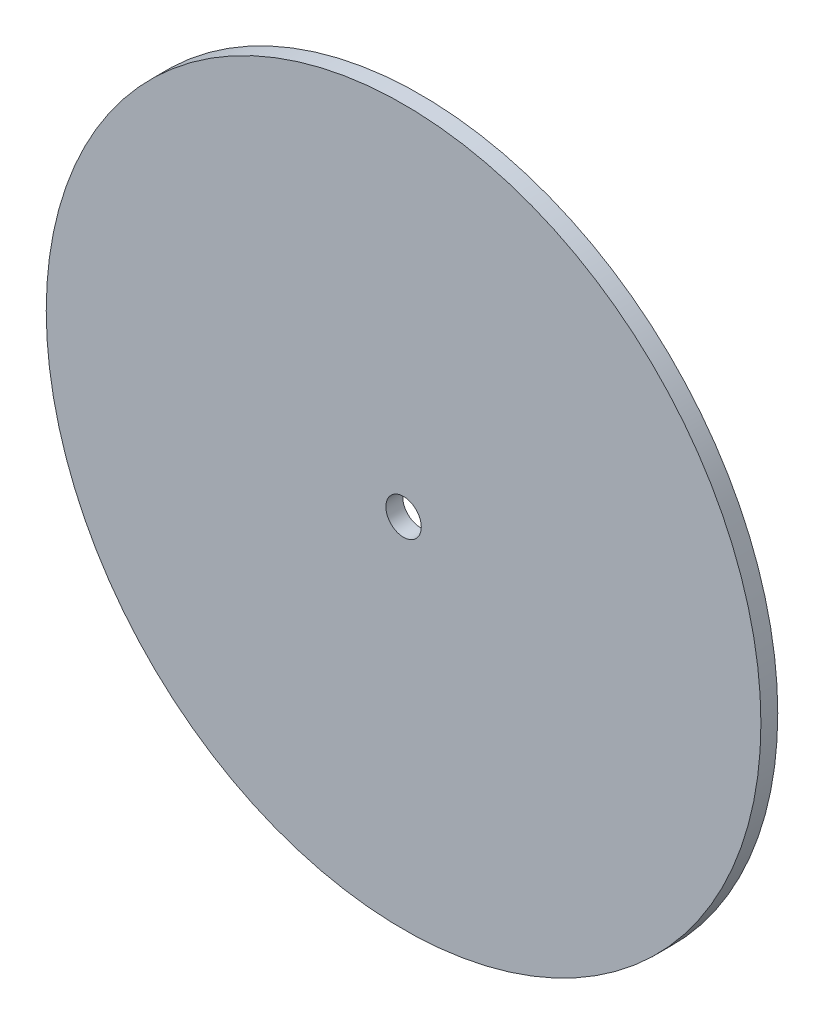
ISO-10303-21;
HEADER;
FILE_DESCRIPTION(('STEP AP214'),'2;1');
FILE_NAME('part.step','',(''),(''),'','','');
FILE_SCHEMA(('AUTOMOTIVE_DESIGN { 1 0 10303 214 1 1 1 1 }'));
ENDSEC;
DATA;
#1=APPLICATION_CONTEXT('core data for automotive mechanical design processes');
#2=APPLICATION_PROTOCOL_DEFINITION('international standard','automotive_design',2000,#1);
#3=PRODUCT_CONTEXT('',#1,'mechanical');
#4=PRODUCT('Part','Part','',(#3));
#5=PRODUCT_RELATED_PRODUCT_CATEGORY('part','',(#4));
#6=PRODUCT_DEFINITION_FORMATION('','',#4);
#7=PRODUCT_DEFINITION_CONTEXT('part definition',#1,'design');
#8=PRODUCT_DEFINITION('design','',#6,#7);
#9=PRODUCT_DEFINITION_SHAPE('','',#8);
#10=(LENGTH_UNIT() NAMED_UNIT(*) SI_UNIT(.MILLI.,.METRE.));
#11=(NAMED_UNIT(*) PLANE_ANGLE_UNIT() SI_UNIT($,.RADIAN.));
#12=(NAMED_UNIT(*) SI_UNIT($,.STERADIAN.) SOLID_ANGLE_UNIT());
#13=UNCERTAINTY_MEASURE_WITH_UNIT(LENGTH_MEASURE(1.E-05),#10,'distance_accuracy_value','');
#14=(GEOMETRIC_REPRESENTATION_CONTEXT(3) GLOBAL_UNCERTAINTY_ASSIGNED_CONTEXT((#13)) GLOBAL_UNIT_ASSIGNED_CONTEXT((#10,
#11,#12)) REPRESENTATION_CONTEXT('',''));
#15=CARTESIAN_POINT('',(0.,0.,0.));
#16=DIRECTION('',(0.,0.,1.));
#17=DIRECTION('',(1.,0.,0.));
#18=AXIS2_PLACEMENT_3D('',#15,#16,#17);
#19=CARTESIAN_POINT('',(0.,0.,5.));
#20=DIRECTION('',(0.,0.,-1.));
#21=DIRECTION('',(-1.,0.,0.));
#22=AXIS2_PLACEMENT_3D('',#19,#20,#21);
#23=CYLINDRICAL_SURFACE('',#22,106.);
#24=CARTESIAN_POINT('',(0.,0.,5.));
#25=DIRECTION('',(0.,0.,1.));
#26=DIRECTION('',(1.,0.,0.));
#27=AXIS2_PLACEMENT_3D('',#24,#25,#26);
#28=CIRCLE('',#27,106.);
#29=CARTESIAN_POINT('',(-106.,0.,5.));
#30=VERTEX_POINT('',#29);
#31=EDGE_CURVE('E12',#30,#30,#28,.T.);
#32=CARTESIAN_POINT('',(0.,0.,0.));
#33=DIRECTION('',(0.,0.,1.));
#34=DIRECTION('',(1.,0.,0.));
#35=AXIS2_PLACEMENT_3D('',#32,#33,#34);
#36=CIRCLE('',#35,106.);
#37=CARTESIAN_POINT('',(-106.,0.,0.));
#38=VERTEX_POINT('',#37);
#39=EDGE_CURVE('E52',#38,#38,#36,.T.);
#40=CARTESIAN_POINT('',(-106.,0.,5.));
#41=CARTESIAN_POINT('',(-106.,0.,4.94791666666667));
#42=CARTESIAN_POINT('',(-106.,0.,4.89583333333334));
#43=CARTESIAN_POINT('',(-106.,0.,4.79166666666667));
#44=CARTESIAN_POINT('',(-106.,0.,4.73958333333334));
#45=CARTESIAN_POINT('',(-106.,0.,4.63541666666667));
#46=CARTESIAN_POINT('',(-106.,0.,4.58333333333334));
#47=CARTESIAN_POINT('',(-106.,0.,4.47916666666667));
#48=CARTESIAN_POINT('',(-106.,0.,4.42708333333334));
#49=CARTESIAN_POINT('',(-106.,0.,4.32291666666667));
#50=CARTESIAN_POINT('',(-106.,0.,4.27083333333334));
#51=CARTESIAN_POINT('',(-106.,0.,4.16666666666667));
#52=CARTESIAN_POINT('',(-106.,0.,4.11458333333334));
#53=CARTESIAN_POINT('',(-106.,0.,4.01041666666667));
#54=CARTESIAN_POINT('',(-106.,0.,3.95833333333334));
#55=CARTESIAN_POINT('',(-106.,0.,3.85416666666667));
#56=CARTESIAN_POINT('',(-106.,0.,3.80208333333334));
#57=CARTESIAN_POINT('',(-106.,0.,3.69791666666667));
#58=CARTESIAN_POINT('',(-106.,0.,3.64583333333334));
#59=CARTESIAN_POINT('',(-106.,0.,3.54166666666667));
#60=CARTESIAN_POINT('',(-106.,0.,3.48958333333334));
#61=CARTESIAN_POINT('',(-106.,0.,3.38541666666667));
#62=CARTESIAN_POINT('',(-106.,0.,3.33333333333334));
#63=CARTESIAN_POINT('',(-106.,0.,3.22916666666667));
#64=CARTESIAN_POINT('',(-106.,0.,3.17708333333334));
#65=CARTESIAN_POINT('',(-106.,0.,3.07291666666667));
#66=CARTESIAN_POINT('',(-106.,0.,3.02083333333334));
#67=CARTESIAN_POINT('',(-106.,0.,2.91666666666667));
#68=CARTESIAN_POINT('',(-106.,0.,2.86458333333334));
#69=CARTESIAN_POINT('',(-106.,0.,2.76041666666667));
#70=CARTESIAN_POINT('',(-106.,0.,2.70833333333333));
#71=CARTESIAN_POINT('',(-106.,0.,2.60416666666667));
#72=CARTESIAN_POINT('',(-106.,0.,2.55208333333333));
#73=CARTESIAN_POINT('',(-106.,0.,2.44791666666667));
#74=CARTESIAN_POINT('',(-106.,0.,2.39583333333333));
#75=CARTESIAN_POINT('',(-106.,0.,2.29166666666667));
#76=CARTESIAN_POINT('',(-106.,0.,2.23958333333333));
#77=CARTESIAN_POINT('',(-106.,0.,2.13541666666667));
#78=CARTESIAN_POINT('',(-106.,0.,2.08333333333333));
#79=CARTESIAN_POINT('',(-106.,0.,1.97916666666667));
#80=CARTESIAN_POINT('',(-106.,0.,1.92708333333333));
#81=CARTESIAN_POINT('',(-106.,0.,1.82291666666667));
#82=CARTESIAN_POINT('',(-106.,0.,1.77083333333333));
#83=CARTESIAN_POINT('',(-106.,0.,1.66666666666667));
#84=CARTESIAN_POINT('',(-106.,0.,1.61458333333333));
#85=CARTESIAN_POINT('',(-106.,0.,1.51041666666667));
#86=CARTESIAN_POINT('',(-106.,0.,1.45833333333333));
#87=CARTESIAN_POINT('',(-106.,0.,1.35416666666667));
#88=CARTESIAN_POINT('',(-106.,0.,1.30208333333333));
#89=CARTESIAN_POINT('',(-106.,0.,1.19791666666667));
#90=CARTESIAN_POINT('',(-106.,0.,1.14583333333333));
#91=CARTESIAN_POINT('',(-106.,0.,1.04166666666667));
#92=CARTESIAN_POINT('',(-106.,0.,0.989583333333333));
#93=CARTESIAN_POINT('',(-106.,0.,0.885416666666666));
#94=CARTESIAN_POINT('',(-106.,0.,0.833333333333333));
#95=CARTESIAN_POINT('',(-106.,0.,0.729166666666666));
#96=CARTESIAN_POINT('',(-106.,0.,0.677083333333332));
#97=CARTESIAN_POINT('',(-106.,0.,0.572916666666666));
#98=CARTESIAN_POINT('',(-106.,0.,0.520833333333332));
#99=CARTESIAN_POINT('',(-106.,0.,0.416666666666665));
#100=CARTESIAN_POINT('',(-106.,0.,0.364583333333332));
#101=CARTESIAN_POINT('',(-106.,0.,0.260416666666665));
#102=CARTESIAN_POINT('',(-106.,0.,0.208333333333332));
#103=CARTESIAN_POINT('',(-106.,0.,0.104166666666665));
#104=CARTESIAN_POINT('',(-106.,0.,0.0520833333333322));
#105=CARTESIAN_POINT('',(-106.,0.,0.));
#106=B_SPLINE_CURVE_WITH_KNOTS('',3,(#40,#41,#42,#43,#44,#45,#46,#47,#48,#49,#50,#51,#52,#53,
#54,#55,#56,#57,#58,#59,#60,#61,#62,#63,#64,#65,#66,#67,#68,#69,#70,#71,#72,#73,#74,#75,#76,#77,
#78,#79,#80,#81,#82,#83,#84,#85,#86,#87,#88,#89,#90,#91,#92,#93,#94,#95,#96,#97,#98,#99,#100,
#101,#102,#103,#104,#105),.UNSPECIFIED.,.F.,.F.,(4,2,2,2,2,2,2,2,2,2,2,2,2,2,2,2,2,2,2,2,2,2,2,
2,2,2,2,2,2,2,2,2,4),(0.,0.156249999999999,0.312499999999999,0.46875,0.625,0.781250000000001,
0.9375,1.09375,1.25,1.40625,1.5625,1.71875,1.875,2.03125,2.1875,2.34375,2.5,2.65625,2.8125,
2.96875,3.125,3.28125,3.4375,3.59375,3.75,3.90625,4.0625,4.21875,4.375,4.53125000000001,
4.68750000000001,4.84375000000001,5.),.UNSPECIFIED.);
#107=EDGE_CURVE('BSEAM49',#30,#38,#106,.T.);
#108=ORIENTED_EDGE('',*,*,#31,.F.);
#109=ORIENTED_EDGE('',*,*,#39,.T.);
#110=ORIENTED_EDGE('',*,*,#107,.T.);
#111=ORIENTED_EDGE('',*,*,#107,.F.);
#112=EDGE_LOOP('',(#108,#110,#109,#111));
#113=FACE_BOUND('',#112,.T.);
#114=ADVANCED_FACE('F49',(#113),#23,.T.);
#115=CARTESIAN_POINT('',(0.,0.,5.));
#116=DIRECTION('',(0.,0.,1.));
#117=DIRECTION('',(1.,0.,0.));
#118=AXIS2_PLACEMENT_3D('',#115,#116,#117);
#119=PLANE('',#118);
#120=CARTESIAN_POINT('',(0.,0.,5.));
#121=DIRECTION('',(0.,0.,1.));
#122=DIRECTION('',(1.,0.,0.));
#123=AXIS2_PLACEMENT_3D('',#120,#121,#122);
#124=CIRCLE('',#123,5.25);
#125=CARTESIAN_POINT('',(5.25,0.,5.));
#126=VERTEX_POINT('',#125);
#127=EDGE_CURVE('E61',#126,#126,#124,.T.);
#128=ORIENTED_EDGE('',*,*,#127,.F.);
#129=EDGE_LOOP('',(#128));
#130=FACE_BOUND('',#129,.T.);
#131=ORIENTED_EDGE('',*,*,#31,.T.);
#132=EDGE_LOOP('',(#131));
#133=FACE_BOUND('',#132,.T.);
#134=ADVANCED_FACE('F76',(#130,#133),#119,.T.);
#135=CARTESIAN_POINT('',(0.,0.,0.));
#136=DIRECTION('',(0.,0.,1.));
#137=DIRECTION('',(1.,0.,0.));
#138=AXIS2_PLACEMENT_3D('',#135,#136,#137);
#139=PLANE('',#138);
#140=CARTESIAN_POINT('',(0.,0.,0.));
#141=DIRECTION('',(0.,0.,1.));
#142=DIRECTION('',(1.,0.,0.));
#143=AXIS2_PLACEMENT_3D('',#140,#141,#142);
#144=CIRCLE('',#143,5.25);
#145=CARTESIAN_POINT('',(5.25,0.,0.));
#146=VERTEX_POINT('',#145);
#147=EDGE_CURVE('E59',#146,#146,#144,.T.);
#148=ORIENTED_EDGE('',*,*,#147,.T.);
#149=EDGE_LOOP('',(#148));
#150=FACE_BOUND('',#149,.T.);
#151=ORIENTED_EDGE('',*,*,#39,.F.);
#152=EDGE_LOOP('',(#151));
#153=FACE_BOUND('',#152,.T.);
#154=ADVANCED_FACE('F67',(#150,#153),#139,.F.);
#155=CARTESIAN_POINT('',(0.,0.,0.));
#156=DIRECTION('',(0.,0.,1.));
#157=DIRECTION('',(1.,0.,0.));
#158=AXIS2_PLACEMENT_3D('',#155,#156,#157);
#159=CYLINDRICAL_SURFACE('',#158,5.25);
#160=CARTESIAN_POINT('',(5.25,0.,0.));
#161=CARTESIAN_POINT('',(5.25,0.,0.0520833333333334));
#162=CARTESIAN_POINT('',(5.25,0.,0.104166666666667));
#163=CARTESIAN_POINT('',(5.25,0.,0.208333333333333));
#164=CARTESIAN_POINT('',(5.25,0.,0.260416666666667));
#165=CARTESIAN_POINT('',(5.25,0.,0.364583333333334));
#166=CARTESIAN_POINT('',(5.25,0.,0.416666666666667));
#167=CARTESIAN_POINT('',(5.25,0.,0.520833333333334));
#168=CARTESIAN_POINT('',(5.25,0.,0.572916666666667));
#169=CARTESIAN_POINT('',(5.25,0.,0.677083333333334));
#170=CARTESIAN_POINT('',(5.25,0.,0.729166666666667));
#171=CARTESIAN_POINT('',(5.25,0.,0.833333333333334));
#172=CARTESIAN_POINT('',(5.25,0.,0.885416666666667));
#173=CARTESIAN_POINT('',(5.25,0.,0.989583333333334));
#174=CARTESIAN_POINT('',(5.25,0.,1.04166666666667));
#175=CARTESIAN_POINT('',(5.25,0.,1.14583333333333));
#176=CARTESIAN_POINT('',(5.25,0.,1.19791666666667));
#177=CARTESIAN_POINT('',(5.25,0.,1.30208333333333));
#178=CARTESIAN_POINT('',(5.25,0.,1.35416666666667));
#179=CARTESIAN_POINT('',(5.25,0.,1.45833333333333));
#180=CARTESIAN_POINT('',(5.25,0.,1.51041666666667));
#181=CARTESIAN_POINT('',(5.25,0.,1.61458333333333));
#182=CARTESIAN_POINT('',(5.25,0.,1.66666666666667));
#183=CARTESIAN_POINT('',(5.25,0.,1.77083333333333));
#184=CARTESIAN_POINT('',(5.25,0.,1.82291666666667));
#185=CARTESIAN_POINT('',(5.25,0.,1.92708333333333));
#186=CARTESIAN_POINT('',(5.25,0.,1.97916666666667));
#187=CARTESIAN_POINT('',(5.25,0.,2.08333333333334));
#188=CARTESIAN_POINT('',(5.25,0.,2.13541666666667));
#189=CARTESIAN_POINT('',(5.25,0.,2.23958333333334));
#190=CARTESIAN_POINT('',(5.25,0.,2.29166666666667));
#191=CARTESIAN_POINT('',(5.25,0.,2.39583333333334));
#192=CARTESIAN_POINT('',(5.25,0.,2.44791666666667));
#193=CARTESIAN_POINT('',(5.25,0.,2.55208333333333));
#194=CARTESIAN_POINT('',(5.25,0.,2.60416666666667));
#195=CARTESIAN_POINT('',(5.25,0.,2.70833333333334));
#196=CARTESIAN_POINT('',(5.25,0.,2.76041666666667));
#197=CARTESIAN_POINT('',(5.25,0.,2.86458333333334));
#198=CARTESIAN_POINT('',(5.25,0.,2.91666666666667));
#199=CARTESIAN_POINT('',(5.25,0.,3.02083333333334));
#200=CARTESIAN_POINT('',(5.25,0.,3.07291666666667));
#201=CARTESIAN_POINT('',(5.25,0.,3.17708333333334));
#202=CARTESIAN_POINT('',(5.25,0.,3.22916666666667));
#203=CARTESIAN_POINT('',(5.25,0.,3.33333333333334));
#204=CARTESIAN_POINT('',(5.25,0.,3.38541666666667));
#205=CARTESIAN_POINT('',(5.25,0.,3.48958333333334));
#206=CARTESIAN_POINT('',(5.25,0.,3.54166666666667));
#207=CARTESIAN_POINT('',(5.25,0.,3.64583333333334));
#208=CARTESIAN_POINT('',(5.25,0.,3.69791666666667));
#209=CARTESIAN_POINT('',(5.25,0.,3.80208333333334));
#210=CARTESIAN_POINT('',(5.25,0.,3.85416666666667));
#211=CARTESIAN_POINT('',(5.25,0.,3.95833333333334));
#212=CARTESIAN_POINT('',(5.25,0.,4.01041666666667));
#213=CARTESIAN_POINT('',(5.25,0.,4.11458333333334));
#214=CARTESIAN_POINT('',(5.25,0.,4.16666666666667));
#215=CARTESIAN_POINT('',(5.25,0.,4.27083333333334));
#216=CARTESIAN_POINT('',(5.25,0.,4.32291666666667));
#217=CARTESIAN_POINT('',(5.25,0.,4.42708333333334));
#218=CARTESIAN_POINT('',(5.25,0.,4.47916666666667));
#219=CARTESIAN_POINT('',(5.25,0.,4.58333333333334));
#220=CARTESIAN_POINT('',(5.25,0.,4.63541666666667));
#221=CARTESIAN_POINT('',(5.25,0.,4.73958333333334));
#222=CARTESIAN_POINT('',(5.25,0.,4.79166666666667));
#223=CARTESIAN_POINT('',(5.25,0.,4.89583333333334));
#224=CARTESIAN_POINT('',(5.25,0.,4.94791666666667));
#225=CARTESIAN_POINT('',(5.25,0.,5.));
#226=B_SPLINE_CURVE_WITH_KNOTS('',3,(#160,#161,#162,#163,#164,#165,#166,#167,#168,#169,#170,
#171,#172,#173,#174,#175,#176,#177,#178,#179,#180,#181,#182,#183,#184,#185,#186,#187,#188,#189,
#190,#191,#192,#193,#194,#195,#196,#197,#198,#199,#200,#201,#202,#203,#204,#205,#206,#207,#208,
#209,#210,#211,#212,#213,#214,#215,#216,#217,#218,#219,#220,#221,#222,#223,#224,#225),
.UNSPECIFIED.,.F.,.F.,(4,2,2,2,2,2,2,2,2,2,2,2,2,2,2,2,2,2,2,2,2,2,2,2,2,2,2,2,2,2,2,2,4),(0.,
0.15625,0.3125,0.46875,0.625,0.781250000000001,0.937500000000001,1.09375,1.25,1.40625,1.5625,
1.71875,1.875,2.03125,2.1875,2.34375,2.5,2.65625,2.8125,2.96875,3.125,3.28125,3.4375,3.59375,
3.75,3.90625,4.0625,4.21875,4.375,4.53125,4.6875,4.84375,5.),.UNSPECIFIED.);
#227=EDGE_CURVE('BSEAM70',#146,#126,#226,.T.);
#228=ORIENTED_EDGE('',*,*,#147,.F.);
#229=ORIENTED_EDGE('',*,*,#127,.T.);
#230=ORIENTED_EDGE('',*,*,#227,.T.);
#231=ORIENTED_EDGE('',*,*,#227,.F.);
#232=EDGE_LOOP('',(#228,#230,#229,#231));
#233=FACE_BOUND('',#232,.T.);
#234=ADVANCED_FACE('F70',(#233),#159,.F.);
#235=CLOSED_SHELL('',(#114,#134,#154,#234));
#236=MANIFOLD_SOLID_BREP('B2',#235);
#237=ADVANCED_BREP_SHAPE_REPRESENTATION('',(#18,#236),#14);
#238=SHAPE_DEFINITION_REPRESENTATION(#9,#237);
ENDSEC;
END-ISO-10303-21;
